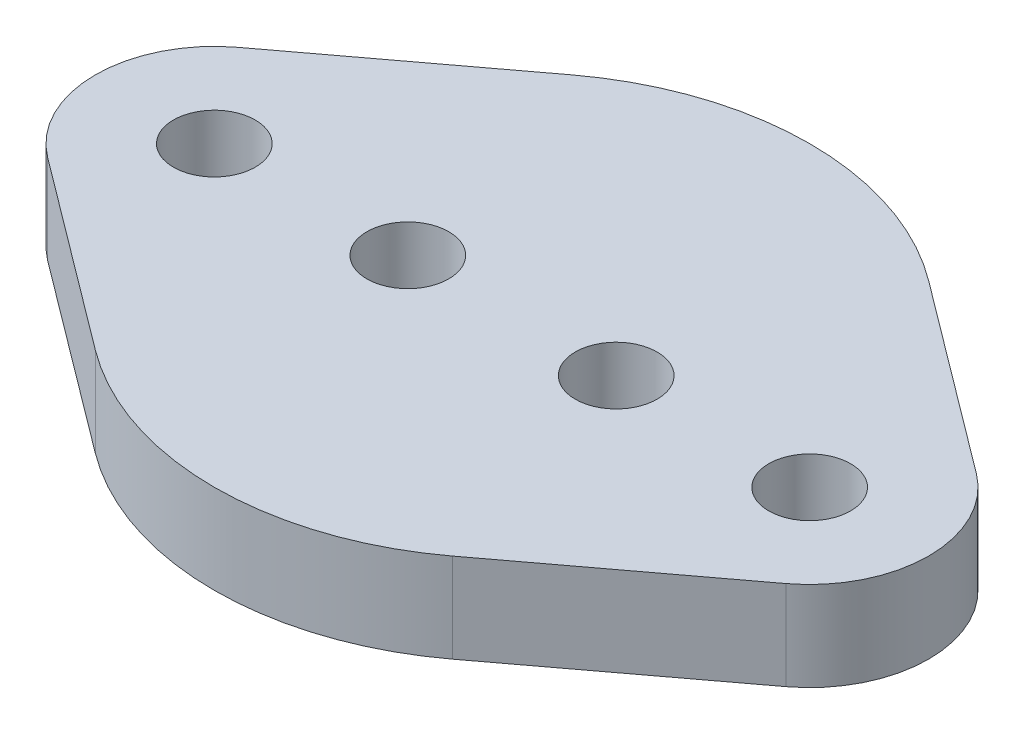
ISO-10303-21;
HEADER;
FILE_DESCRIPTION(('STEP AP214'),'2;1');
FILE_NAME('part.step','',(''),(''),'','','');
FILE_SCHEMA(('AUTOMOTIVE_DESIGN { 1 0 10303 214 1 1 1 1 }'));
ENDSEC;
DATA;
#1=APPLICATION_CONTEXT('core data for automotive mechanical design processes');
#2=APPLICATION_PROTOCOL_DEFINITION('international standard','automotive_design',2000,#1);
#3=PRODUCT_CONTEXT('',#1,'mechanical');
#4=PRODUCT('Part','Part','',(#3));
#5=PRODUCT_RELATED_PRODUCT_CATEGORY('part','',(#4));
#6=PRODUCT_DEFINITION_FORMATION('','',#4);
#7=PRODUCT_DEFINITION_CONTEXT('part definition',#1,'design');
#8=PRODUCT_DEFINITION('design','',#6,#7);
#9=PRODUCT_DEFINITION_SHAPE('','',#8);
#10=(LENGTH_UNIT() NAMED_UNIT(*) SI_UNIT(.MILLI.,.METRE.));
#11=(NAMED_UNIT(*) PLANE_ANGLE_UNIT() SI_UNIT($,.RADIAN.));
#12=(NAMED_UNIT(*) SI_UNIT($,.STERADIAN.) SOLID_ANGLE_UNIT());
#13=UNCERTAINTY_MEASURE_WITH_UNIT(LENGTH_MEASURE(1.E-05),#10,'distance_accuracy_value','');
#14=(GEOMETRIC_REPRESENTATION_CONTEXT(3) GLOBAL_UNCERTAINTY_ASSIGNED_CONTEXT((#13)) GLOBAL_UNIT_ASSIGNED_CONTEXT((#10,
#11,#12)) REPRESENTATION_CONTEXT('',''));
#15=CARTESIAN_POINT('',(0.,0.,0.));
#16=DIRECTION('',(0.,0.,1.));
#17=DIRECTION('',(1.,0.,0.));
#18=AXIS2_PLACEMENT_3D('',#15,#16,#17);
#19=CARTESIAN_POINT('',(0.,6.,0.));
#20=DIRECTION('',(0.,1.,0.));
#21=DIRECTION('',(0.,0.,1.));
#22=AXIS2_PLACEMENT_3D('',#19,#20,#21);
#23=PLANE('',#22);
#24=CARTESIAN_POINT('',(-20.,6.,0.));
#25=DIRECTION('',(0.,1.,0.));
#26=DIRECTION('',(0.,0.,-1.));
#27=AXIS2_PLACEMENT_3D('',#24,#25,#26);
#28=CIRCLE('',#27,2.75);
#29=CARTESIAN_POINT('',(-20.,6.,-2.75));
#30=VERTEX_POINT('',#29);
#31=EDGE_CURVE('E232',#30,#30,#28,.T.);
#32=ORIENTED_EDGE('',*,*,#31,.F.);
#33=EDGE_LOOP('',(#32));
#34=FACE_BOUND('',#33,.T.);
#35=CARTESIAN_POINT('',(7.,6.,0.));
#36=DIRECTION('',(0.,1.,0.));
#37=DIRECTION('',(0.,0.,1.));
#38=AXIS2_PLACEMENT_3D('',#35,#36,#37);
#39=CIRCLE('',#38,2.75);
#40=CARTESIAN_POINT('',(7.,6.,2.75));
#41=VERTEX_POINT('',#40);
#42=EDGE_CURVE('E114',#41,#41,#39,.T.);
#43=ORIENTED_EDGE('',*,*,#42,.F.);
#44=EDGE_LOOP('',(#43));
#45=FACE_BOUND('',#44,.T.);
#46=CARTESIAN_POINT('',(0.,6.,0.));
#47=DIRECTION('',(0.,1.,0.));
#48=DIRECTION('',(0.,0.,1.));
#49=AXIS2_PLACEMENT_3D('',#46,#47,#48);
#50=CIRCLE('',#49,20.);
#51=CARTESIAN_POINT('',(12.,6.,-16.));
#52=VERTEX_POINT('',#51);
#53=CARTESIAN_POINT('',(-12.,6.,-16.));
#54=VERTEX_POINT('',#53);
#55=EDGE_CURVE('E132',#52,#54,#50,.T.);
#56=ORIENTED_EDGE('',*,*,#55,.T.);
#57=DIRECTION('',(-0.8,0.,0.6));
#58=VECTOR('',#57,1.);
#59=CARTESIAN_POINT('',(-12.,6.,-16.));
#60=LINE('',#59,#58);
#61=CARTESIAN_POINT('',(-24.8,6.,-6.4));
#62=VERTEX_POINT('',#61);
#63=EDGE_CURVE('E109',#54,#62,#60,.T.);
#64=ORIENTED_EDGE('',*,*,#63,.T.);
#65=CARTESIAN_POINT('',(-20.,6.,0.));
#66=DIRECTION('',(0.,1.,0.));
#67=DIRECTION('',(0.,0.,-1.));
#68=AXIS2_PLACEMENT_3D('',#65,#66,#67);
#69=CIRCLE('',#68,8.);
#70=CARTESIAN_POINT('',(-24.8,6.,6.4));
#71=VERTEX_POINT('',#70);
#72=EDGE_CURVE('E135',#62,#71,#69,.T.);
#73=ORIENTED_EDGE('',*,*,#72,.T.);
#74=DIRECTION('',(0.8,0.,0.6));
#75=VECTOR('',#74,1.);
#76=CARTESIAN_POINT('',(-12.,6.,16.));
#77=LINE('',#76,#75);
#78=CARTESIAN_POINT('',(-12.,6.,16.));
#79=VERTEX_POINT('',#78);
#80=EDGE_CURVE('E137',#71,#79,#77,.T.);
#81=ORIENTED_EDGE('',*,*,#80,.T.);
#82=CARTESIAN_POINT('',(0.,6.,0.));
#83=DIRECTION('',(0.,1.,0.));
#84=DIRECTION('',(0.,0.,1.));
#85=AXIS2_PLACEMENT_3D('',#82,#83,#84);
#86=CIRCLE('',#85,20.);
#87=CARTESIAN_POINT('',(12.,6.,16.));
#88=VERTEX_POINT('',#87);
#89=EDGE_CURVE('E139',#79,#88,#86,.T.);
#90=ORIENTED_EDGE('',*,*,#89,.T.);
#91=DIRECTION('',(0.8,0.,-0.6));
#92=VECTOR('',#91,1.);
#93=CARTESIAN_POINT('',(12.,6.,16.));
#94=LINE('',#93,#92);
#95=CARTESIAN_POINT('',(24.8,6.,6.40000000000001));
#96=VERTEX_POINT('',#95);
#97=EDGE_CURVE('E141',#88,#96,#94,.T.);
#98=ORIENTED_EDGE('',*,*,#97,.T.);
#99=CARTESIAN_POINT('',(20.,6.,0.));
#100=DIRECTION('',(0.,1.,0.));
#101=DIRECTION('',(0.,0.,1.));
#102=AXIS2_PLACEMENT_3D('',#99,#100,#101);
#103=CIRCLE('',#102,8.);
#104=CARTESIAN_POINT('',(24.8,6.,-6.4));
#105=VERTEX_POINT('',#104);
#106=EDGE_CURVE('E50',#96,#105,#103,.T.);
#107=ORIENTED_EDGE('',*,*,#106,.T.);
#108=DIRECTION('',(-0.8,0.,-0.6));
#109=VECTOR('',#108,1.);
#110=CARTESIAN_POINT('',(12.,6.,-16.));
#111=LINE('',#110,#109);
#112=EDGE_CURVE('E45',#105,#52,#111,.T.);
#113=ORIENTED_EDGE('',*,*,#112,.T.);
#114=EDGE_LOOP('',(#56,#64,#73,#81,#90,#98,#107,#113));
#115=FACE_BOUND('',#114,.T.);
#116=CARTESIAN_POINT('',(20.,6.,0.));
#117=DIRECTION('',(0.,1.,0.));
#118=DIRECTION('',(0.,0.,1.));
#119=AXIS2_PLACEMENT_3D('',#116,#117,#118);
#120=CIRCLE('',#119,2.75);
#121=CARTESIAN_POINT('',(20.,6.,2.75));
#122=VERTEX_POINT('',#121);
#123=EDGE_CURVE('E238',#122,#122,#120,.T.);
#124=ORIENTED_EDGE('',*,*,#123,.F.);
#125=EDGE_LOOP('',(#124));
#126=FACE_BOUND('',#125,.T.);
#127=CARTESIAN_POINT('',(-7.,6.,0.));
#128=DIRECTION('',(0.,1.,0.));
#129=DIRECTION('',(0.,0.,-1.));
#130=AXIS2_PLACEMENT_3D('',#127,#128,#129);
#131=CIRCLE('',#130,2.75);
#132=CARTESIAN_POINT('',(-7.,6.,-2.75));
#133=VERTEX_POINT('',#132);
#134=EDGE_CURVE('E221',#133,#133,#131,.T.);
#135=ORIENTED_EDGE('',*,*,#134,.F.);
#136=EDGE_LOOP('',(#135));
#137=FACE_BOUND('',#136,.T.);
#138=ADVANCED_FACE('F30',(#34,#45,#115,#126,#137),#23,.T.);
#139=CARTESIAN_POINT('',(0.,0.,0.));
#140=DIRECTION('',(0.,1.,0.));
#141=DIRECTION('',(0.,0.,1.));
#142=AXIS2_PLACEMENT_3D('',#139,#140,#141);
#143=PLANE('',#142);
#144=CARTESIAN_POINT('',(-20.,0.,0.));
#145=DIRECTION('',(0.,1.,0.));
#146=DIRECTION('',(0.,0.,-1.));
#147=AXIS2_PLACEMENT_3D('',#144,#145,#146);
#148=CIRCLE('',#147,2.75);
#149=CARTESIAN_POINT('',(-20.,0.,-2.75));
#150=VERTEX_POINT('',#149);
#151=EDGE_CURVE('E227',#150,#150,#148,.T.);
#152=ORIENTED_EDGE('',*,*,#151,.T.);
#153=EDGE_LOOP('',(#152));
#154=FACE_BOUND('',#153,.T.);
#155=CARTESIAN_POINT('',(7.,0.,0.));
#156=DIRECTION('',(0.,1.,0.));
#157=DIRECTION('',(0.,0.,1.));
#158=AXIS2_PLACEMENT_3D('',#155,#156,#157);
#159=CIRCLE('',#158,2.75);
#160=CARTESIAN_POINT('',(7.,0.,2.75));
#161=VERTEX_POINT('',#160);
#162=EDGE_CURVE('E117',#161,#161,#159,.T.);
#163=ORIENTED_EDGE('',*,*,#162,.T.);
#164=EDGE_LOOP('',(#163));
#165=FACE_BOUND('',#164,.T.);
#166=CARTESIAN_POINT('',(0.,0.,0.));
#167=DIRECTION('',(0.,1.,0.));
#168=DIRECTION('',(0.,0.,1.));
#169=AXIS2_PLACEMENT_3D('',#166,#167,#168);
#170=CIRCLE('',#169,20.);
#171=CARTESIAN_POINT('',(12.,0.,-16.));
#172=VERTEX_POINT('',#171);
#173=CARTESIAN_POINT('',(-12.,0.,-16.));
#174=VERTEX_POINT('',#173);
#175=EDGE_CURVE('E100',#172,#174,#170,.T.);
#176=ORIENTED_EDGE('',*,*,#175,.F.);
#177=DIRECTION('',(-0.8,0.,-0.6));
#178=VECTOR('',#177,1.);
#179=CARTESIAN_POINT('',(12.,0.,-16.));
#180=LINE('',#179,#178);
#181=CARTESIAN_POINT('',(24.8,0.,-6.4));
#182=VERTEX_POINT('',#181);
#183=EDGE_CURVE('E130',#182,#172,#180,.T.);
#184=ORIENTED_EDGE('',*,*,#183,.F.);
#185=CARTESIAN_POINT('',(20.,0.,0.));
#186=DIRECTION('',(0.,1.,0.));
#187=DIRECTION('',(0.,0.,1.));
#188=AXIS2_PLACEMENT_3D('',#185,#186,#187);
#189=CIRCLE('',#188,8.);
#190=CARTESIAN_POINT('',(24.8,0.,6.40000000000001));
#191=VERTEX_POINT('',#190);
#192=EDGE_CURVE('E128',#191,#182,#189,.T.);
#193=ORIENTED_EDGE('',*,*,#192,.F.);
#194=DIRECTION('',(0.8,0.,-0.6));
#195=VECTOR('',#194,1.);
#196=CARTESIAN_POINT('',(12.,0.,16.));
#197=LINE('',#196,#195);
#198=CARTESIAN_POINT('',(12.,0.,16.));
#199=VERTEX_POINT('',#198);
#200=EDGE_CURVE('E126',#199,#191,#197,.T.);
#201=ORIENTED_EDGE('',*,*,#200,.F.);
#202=CARTESIAN_POINT('',(0.,0.,0.));
#203=DIRECTION('',(0.,1.,0.));
#204=DIRECTION('',(0.,0.,1.));
#205=AXIS2_PLACEMENT_3D('',#202,#203,#204);
#206=CIRCLE('',#205,20.);
#207=CARTESIAN_POINT('',(-12.,0.,16.));
#208=VERTEX_POINT('',#207);
#209=EDGE_CURVE('E124',#208,#199,#206,.T.);
#210=ORIENTED_EDGE('',*,*,#209,.F.);
#211=DIRECTION('',(0.8,0.,0.6));
#212=VECTOR('',#211,1.);
#213=CARTESIAN_POINT('',(-12.,0.,16.));
#214=LINE('',#213,#212);
#215=CARTESIAN_POINT('',(-24.8,0.,6.4));
#216=VERTEX_POINT('',#215);
#217=EDGE_CURVE('E122',#216,#208,#214,.T.);
#218=ORIENTED_EDGE('',*,*,#217,.F.);
#219=CARTESIAN_POINT('',(-20.,0.,0.));
#220=DIRECTION('',(0.,1.,0.));
#221=DIRECTION('',(0.,0.,-1.));
#222=AXIS2_PLACEMENT_3D('',#219,#220,#221);
#223=CIRCLE('',#222,8.);
#224=CARTESIAN_POINT('',(-24.8,0.,-6.4));
#225=VERTEX_POINT('',#224);
#226=EDGE_CURVE('E102',#225,#216,#223,.T.);
#227=ORIENTED_EDGE('',*,*,#226,.F.);
#228=DIRECTION('',(-0.8,0.,0.6));
#229=VECTOR('',#228,1.);
#230=CARTESIAN_POINT('',(-12.,0.,-16.));
#231=LINE('',#230,#229);
#232=EDGE_CURVE('E95',#174,#225,#231,.T.);
#233=ORIENTED_EDGE('',*,*,#232,.F.);
#234=EDGE_LOOP('',(#176,#184,#193,#201,#210,#218,#227,#233));
#235=FACE_BOUND('',#234,.T.);
#236=CARTESIAN_POINT('',(20.,0.,0.));
#237=DIRECTION('',(0.,1.,0.));
#238=DIRECTION('',(0.,0.,1.));
#239=AXIS2_PLACEMENT_3D('',#236,#237,#238);
#240=CIRCLE('',#239,2.75);
#241=CARTESIAN_POINT('',(20.,0.,2.75));
#242=VERTEX_POINT('',#241);
#243=EDGE_CURVE('E235',#242,#242,#240,.T.);
#244=ORIENTED_EDGE('',*,*,#243,.T.);
#245=EDGE_LOOP('',(#244));
#246=FACE_BOUND('',#245,.T.);
#247=CARTESIAN_POINT('',(-7.,0.,0.));
#248=DIRECTION('',(0.,1.,0.));
#249=DIRECTION('',(0.,0.,-1.));
#250=AXIS2_PLACEMENT_3D('',#247,#248,#249);
#251=CIRCLE('',#250,2.75);
#252=CARTESIAN_POINT('',(-7.,0.,-2.75));
#253=VERTEX_POINT('',#252);
#254=EDGE_CURVE('E224',#253,#253,#251,.T.);
#255=ORIENTED_EDGE('',*,*,#254,.T.);
#256=EDGE_LOOP('',(#255));
#257=FACE_BOUND('',#256,.T.);
#258=ADVANCED_FACE('F96',(#154,#165,#235,#246,#257),#143,.F.);
#259=CARTESIAN_POINT('',(0.,6.,0.));
#260=DIRECTION('',(0.,-1.,0.));
#261=DIRECTION('',(0.,0.,-1.));
#262=AXIS2_PLACEMENT_3D('',#259,#260,#261);
#263=CYLINDRICAL_SURFACE('',#262,20.);
#264=ORIENTED_EDGE('',*,*,#175,.T.);
#265=DIRECTION('',(0.,-1.,0.));
#266=VECTOR('',#265,1.);
#267=CARTESIAN_POINT('',(-12.,6.,-16.));
#268=LINE('',#267,#266);
#269=EDGE_CURVE('E11',#54,#174,#268,.T.);
#270=ORIENTED_EDGE('',*,*,#269,.F.);
#271=ORIENTED_EDGE('',*,*,#55,.F.);
#272=DIRECTION('',(0.,-1.,0.));
#273=VECTOR('',#272,1.);
#274=CARTESIAN_POINT('',(12.,6.,-16.));
#275=LINE('',#274,#273);
#276=EDGE_CURVE('E113',#52,#172,#275,.T.);
#277=ORIENTED_EDGE('',*,*,#276,.T.);
#278=EDGE_LOOP('',(#264,#270,#271,#277));
#279=FACE_BOUND('',#278,.T.);
#280=ADVANCED_FACE('F32',(#279),#263,.T.);
#281=CARTESIAN_POINT('',(-12.,6.,-16.));
#282=DIRECTION('',(0.6,0.,0.8));
#283=DIRECTION('',(0.8,0.,-0.6));
#284=AXIS2_PLACEMENT_3D('',#281,#282,#283);
#285=PLANE('',#284);
#286=ORIENTED_EDGE('',*,*,#232,.T.);
#287=DIRECTION('',(0.,-1.,0.));
#288=VECTOR('',#287,1.);
#289=CARTESIAN_POINT('',(-24.8,6.,-6.4));
#290=LINE('',#289,#288);
#291=EDGE_CURVE('E38',#62,#225,#290,.T.);
#292=ORIENTED_EDGE('',*,*,#291,.F.);
#293=ORIENTED_EDGE('',*,*,#63,.F.);
#294=ORIENTED_EDGE('',*,*,#269,.T.);
#295=EDGE_LOOP('',(#286,#292,#293,#294));
#296=FACE_BOUND('',#295,.T.);
#297=ADVANCED_FACE('F108',(#296),#285,.F.);
#298=CARTESIAN_POINT('',(-20.,6.,0.));
#299=DIRECTION('',(0.,-1.,0.));
#300=DIRECTION('',(0.,0.,-1.));
#301=AXIS2_PLACEMENT_3D('',#298,#299,#300);
#302=CYLINDRICAL_SURFACE('',#301,8.);
#303=ORIENTED_EDGE('',*,*,#226,.T.);
#304=DIRECTION('',(0.,-1.,0.));
#305=VECTOR('',#304,1.);
#306=CARTESIAN_POINT('',(-24.8,6.,6.4));
#307=LINE('',#306,#305);
#308=EDGE_CURVE('E158',#71,#216,#307,.T.);
#309=ORIENTED_EDGE('',*,*,#308,.F.);
#310=ORIENTED_EDGE('',*,*,#72,.F.);
#311=ORIENTED_EDGE('',*,*,#291,.T.);
#312=EDGE_LOOP('',(#303,#309,#310,#311));
#313=FACE_BOUND('',#312,.T.);
#314=ADVANCED_FACE('F162',(#313),#302,.T.);
#315=CARTESIAN_POINT('',(-12.,6.,16.));
#316=DIRECTION('',(0.6,0.,-0.8));
#317=DIRECTION('',(-0.8,0.,-0.6));
#318=AXIS2_PLACEMENT_3D('',#315,#316,#317);
#319=PLANE('',#318);
#320=ORIENTED_EDGE('',*,*,#217,.T.);
#321=DIRECTION('',(0.,-1.,0.));
#322=VECTOR('',#321,1.);
#323=CARTESIAN_POINT('',(-12.,6.,16.));
#324=LINE('',#323,#322);
#325=EDGE_CURVE('E155',#79,#208,#324,.T.);
#326=ORIENTED_EDGE('',*,*,#325,.F.);
#327=ORIENTED_EDGE('',*,*,#80,.F.);
#328=ORIENTED_EDGE('',*,*,#308,.T.);
#329=EDGE_LOOP('',(#320,#326,#327,#328));
#330=FACE_BOUND('',#329,.T.);
#331=ADVANCED_FACE('F170',(#330),#319,.F.);
#332=CARTESIAN_POINT('',(0.,6.,0.));
#333=DIRECTION('',(0.,-1.,0.));
#334=DIRECTION('',(0.,0.,-1.));
#335=AXIS2_PLACEMENT_3D('',#332,#333,#334);
#336=CYLINDRICAL_SURFACE('',#335,20.);
#337=ORIENTED_EDGE('',*,*,#209,.T.);
#338=DIRECTION('',(0.,-1.,0.));
#339=VECTOR('',#338,1.);
#340=CARTESIAN_POINT('',(12.,6.,16.));
#341=LINE('',#340,#339);
#342=EDGE_CURVE('E152',#88,#199,#341,.T.);
#343=ORIENTED_EDGE('',*,*,#342,.F.);
#344=ORIENTED_EDGE('',*,*,#89,.F.);
#345=ORIENTED_EDGE('',*,*,#325,.T.);
#346=EDGE_LOOP('',(#337,#343,#344,#345));
#347=FACE_BOUND('',#346,.T.);
#348=ADVANCED_FACE('F173',(#347),#336,.T.);
#349=CARTESIAN_POINT('',(12.,6.,16.));
#350=DIRECTION('',(-0.6,0.,-0.8));
#351=DIRECTION('',(-0.8,0.,0.6));
#352=AXIS2_PLACEMENT_3D('',#349,#350,#351);
#353=PLANE('',#352);
#354=ORIENTED_EDGE('',*,*,#200,.T.);
#355=DIRECTION('',(0.,-1.,0.));
#356=VECTOR('',#355,1.);
#357=CARTESIAN_POINT('',(24.8,6.,6.40000000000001));
#358=LINE('',#357,#356);
#359=EDGE_CURVE('E149',#96,#191,#358,.T.);
#360=ORIENTED_EDGE('',*,*,#359,.F.);
#361=ORIENTED_EDGE('',*,*,#97,.F.);
#362=ORIENTED_EDGE('',*,*,#342,.T.);
#363=EDGE_LOOP('',(#354,#360,#361,#362));
#364=FACE_BOUND('',#363,.T.);
#365=ADVANCED_FACE('F178',(#364),#353,.F.);
#366=CARTESIAN_POINT('',(20.,6.,0.));
#367=DIRECTION('',(0.,-1.,0.));
#368=DIRECTION('',(0.,0.,-1.));
#369=AXIS2_PLACEMENT_3D('',#366,#367,#368);
#370=CYLINDRICAL_SURFACE('',#369,8.);
#371=ORIENTED_EDGE('',*,*,#192,.T.);
#372=DIRECTION('',(0.,-1.,0.));
#373=VECTOR('',#372,1.);
#374=CARTESIAN_POINT('',(24.8,6.,-6.4));
#375=LINE('',#374,#373);
#376=EDGE_CURVE('E146',#105,#182,#375,.T.);
#377=ORIENTED_EDGE('',*,*,#376,.F.);
#378=ORIENTED_EDGE('',*,*,#106,.F.);
#379=ORIENTED_EDGE('',*,*,#359,.T.);
#380=EDGE_LOOP('',(#371,#377,#378,#379));
#381=FACE_BOUND('',#380,.T.);
#382=ADVANCED_FACE('F181',(#381),#370,.T.);
#383=CARTESIAN_POINT('',(12.,6.,-16.));
#384=DIRECTION('',(-0.6,0.,0.8));
#385=DIRECTION('',(0.8,0.,0.6));
#386=AXIS2_PLACEMENT_3D('',#383,#384,#385);
#387=PLANE('',#386);
#388=ORIENTED_EDGE('',*,*,#183,.T.);
#389=ORIENTED_EDGE('',*,*,#276,.F.);
#390=ORIENTED_EDGE('',*,*,#112,.F.);
#391=ORIENTED_EDGE('',*,*,#376,.T.);
#392=EDGE_LOOP('',(#388,#389,#390,#391));
#393=FACE_BOUND('',#392,.T.);
#394=ADVANCED_FACE('F183',(#393),#387,.F.);
#395=CARTESIAN_POINT('',(7.,6.,0.));
#396=DIRECTION('',(0.,-1.,0.));
#397=DIRECTION('',(0.,0.,-1.));
#398=AXIS2_PLACEMENT_3D('',#395,#396,#397);
#399=CYLINDRICAL_SURFACE('',#398,2.75);
#400=ORIENTED_EDGE('',*,*,#42,.T.);
#401=EDGE_LOOP('',(#400));
#402=FACE_BOUND('',#401,.T.);
#403=ORIENTED_EDGE('',*,*,#162,.F.);
#404=EDGE_LOOP('',(#403));
#405=FACE_BOUND('',#404,.T.);
#406=ADVANCED_FACE('F185',(#402,#405),#399,.F.);
#407=CARTESIAN_POINT('',(20.,6.,0.));
#408=DIRECTION('',(0.,-1.,0.));
#409=DIRECTION('',(0.,0.,-1.));
#410=AXIS2_PLACEMENT_3D('',#407,#408,#409);
#411=CYLINDRICAL_SURFACE('',#410,2.75);
#412=ORIENTED_EDGE('',*,*,#123,.T.);
#413=EDGE_LOOP('',(#412));
#414=FACE_BOUND('',#413,.T.);
#415=ORIENTED_EDGE('',*,*,#243,.F.);
#416=EDGE_LOOP('',(#415));
#417=FACE_BOUND('',#416,.T.);
#418=ADVANCED_FACE('F191',(#414,#417),#411,.F.);
#419=CARTESIAN_POINT('',(-20.,6.,0.));
#420=DIRECTION('',(0.,-1.,0.));
#421=DIRECTION('',(0.,0.,-1.));
#422=AXIS2_PLACEMENT_3D('',#419,#420,#421);
#423=CYLINDRICAL_SURFACE('',#422,2.75);
#424=ORIENTED_EDGE('',*,*,#31,.T.);
#425=EDGE_LOOP('',(#424));
#426=FACE_BOUND('',#425,.T.);
#427=ORIENTED_EDGE('',*,*,#151,.F.);
#428=EDGE_LOOP('',(#427));
#429=FACE_BOUND('',#428,.T.);
#430=ADVANCED_FACE('F208',(#426,#429),#423,.F.);
#431=CARTESIAN_POINT('',(-7.,6.,0.));
#432=DIRECTION('',(0.,-1.,0.));
#433=DIRECTION('',(0.,0.,-1.));
#434=AXIS2_PLACEMENT_3D('',#431,#432,#433);
#435=CYLINDRICAL_SURFACE('',#434,2.75);
#436=ORIENTED_EDGE('',*,*,#134,.T.);
#437=EDGE_LOOP('',(#436));
#438=FACE_BOUND('',#437,.T.);
#439=ORIENTED_EDGE('',*,*,#254,.F.);
#440=EDGE_LOOP('',(#439));
#441=FACE_BOUND('',#440,.T.);
#442=ADVANCED_FACE('F212',(#438,#441),#435,.F.);
#443=CLOSED_SHELL('',(#138,#258,#280,#297,#314,#331,#348,#365,#382,#394,#406,#418,#430,#442));
#444=MANIFOLD_SOLID_BREP('B2',#443);
#445=ADVANCED_BREP_SHAPE_REPRESENTATION('',(#18,#444),#14);
#446=SHAPE_DEFINITION_REPRESENTATION(#9,#445);
ENDSEC;
END-ISO-10303-21;
